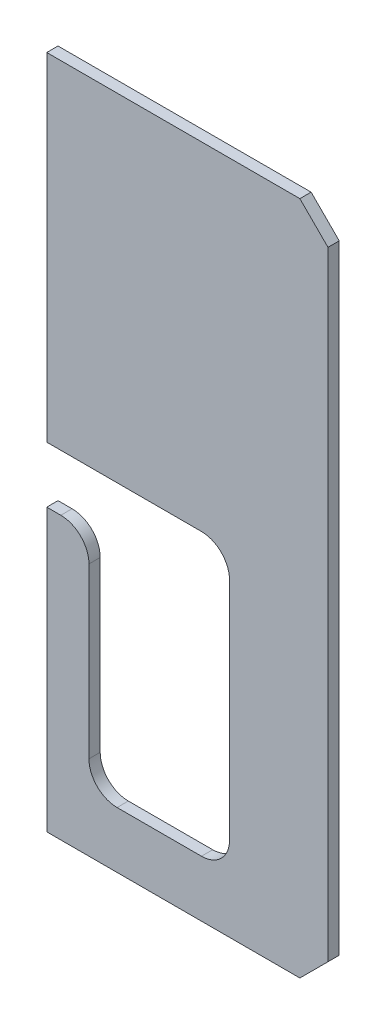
ISO-10303-21;
HEADER;
FILE_DESCRIPTION(('STEP AP214'),'2;1');
FILE_NAME('part.step','',(''),(''),'','','');
FILE_SCHEMA(('AUTOMOTIVE_DESIGN { 1 0 10303 214 1 1 1 1 }'));
ENDSEC;
DATA;
#1=APPLICATION_CONTEXT('core data for automotive mechanical design processes');
#2=APPLICATION_PROTOCOL_DEFINITION('international standard','automotive_design',2000,#1);
#3=PRODUCT_CONTEXT('',#1,'mechanical');
#4=PRODUCT('Part','Part','',(#3));
#5=PRODUCT_RELATED_PRODUCT_CATEGORY('part','',(#4));
#6=PRODUCT_DEFINITION_FORMATION('','',#4);
#7=PRODUCT_DEFINITION_CONTEXT('part definition',#1,'design');
#8=PRODUCT_DEFINITION('design','',#6,#7);
#9=PRODUCT_DEFINITION_SHAPE('','',#8);
#10=(LENGTH_UNIT() NAMED_UNIT(*) SI_UNIT(.MILLI.,.METRE.));
#11=(NAMED_UNIT(*) PLANE_ANGLE_UNIT() SI_UNIT($,.RADIAN.));
#12=(NAMED_UNIT(*) SI_UNIT($,.STERADIAN.) SOLID_ANGLE_UNIT());
#13=UNCERTAINTY_MEASURE_WITH_UNIT(LENGTH_MEASURE(1.E-05),#10,'distance_accuracy_value','');
#14=(GEOMETRIC_REPRESENTATION_CONTEXT(3) GLOBAL_UNCERTAINTY_ASSIGNED_CONTEXT((#13)) GLOBAL_UNIT_ASSIGNED_CONTEXT((#10,
#11,#12)) REPRESENTATION_CONTEXT('',''));
#15=CARTESIAN_POINT('',(0.,0.,0.));
#16=DIRECTION('',(0.,0.,1.));
#17=DIRECTION('',(1.,0.,0.));
#18=AXIS2_PLACEMENT_3D('',#15,#16,#17);
#19=CARTESIAN_POINT('',(0.,0.,4.));
#20=DIRECTION('',(1.,0.,0.));
#21=DIRECTION('',(0.,0.,-1.));
#22=AXIS2_PLACEMENT_3D('',#19,#20,#21);
#23=PLANE('',#22);
#24=DIRECTION('',(0.,-1.,0.));
#25=VECTOR('',#24,1.);
#26=CARTESIAN_POINT('',(0.,0.,0.));
#27=LINE('',#26,#25);
#28=CARTESIAN_POINT('',(0.,100.,0.));
#29=VERTEX_POINT('',#28);
#30=CARTESIAN_POINT('',(0.,0.,0.));
#31=VERTEX_POINT('',#30);
#32=EDGE_CURVE('E153',#29,#31,#27,.T.);
#33=ORIENTED_EDGE('',*,*,#32,.T.);
#34=DIRECTION('',(0.,0.,-1.));
#35=VECTOR('',#34,1.);
#36=CARTESIAN_POINT('',(0.,0.,4.));
#37=LINE('',#36,#35);
#38=CARTESIAN_POINT('',(0.,0.,4.));
#39=VERTEX_POINT('',#38);
#40=EDGE_CURVE('E11',#39,#31,#37,.T.);
#41=ORIENTED_EDGE('',*,*,#40,.F.);
#42=DIRECTION('',(0.,-1.,0.));
#43=VECTOR('',#42,1.);
#44=CARTESIAN_POINT('',(0.,0.,4.));
#45=LINE('',#44,#43);
#46=CARTESIAN_POINT('',(0.,100.,4.));
#47=VERTEX_POINT('',#46);
#48=EDGE_CURVE('E214',#47,#39,#45,.T.);
#49=ORIENTED_EDGE('',*,*,#48,.F.);
#50=DIRECTION('',(0.,0.,-1.));
#51=VECTOR('',#50,1.);
#52=CARTESIAN_POINT('',(0.,100.,4.));
#53=LINE('',#52,#51);
#54=EDGE_CURVE('E167',#47,#29,#53,.T.);
#55=ORIENTED_EDGE('',*,*,#54,.T.);
#56=EDGE_LOOP('',(#33,#41,#49,#55));
#57=FACE_BOUND('',#56,.T.);
#58=ADVANCED_FACE('F36',(#57),#23,.F.);
#59=CARTESIAN_POINT('',(0.,0.,4.));
#60=DIRECTION('',(0.,1.,0.));
#61=DIRECTION('',(0.,0.,1.));
#62=AXIS2_PLACEMENT_3D('',#59,#60,#61);
#63=PLANE('',#62);
#64=DIRECTION('',(1.,0.,0.));
#65=VECTOR('',#64,1.);
#66=CARTESIAN_POINT('',(0.,0.,0.));
#67=LINE('',#66,#65);
#68=CARTESIAN_POINT('',(90.,0.,0.));
#69=VERTEX_POINT('',#68);
#70=EDGE_CURVE('E149',#31,#69,#67,.T.);
#71=ORIENTED_EDGE('',*,*,#70,.T.);
#72=DIRECTION('',(0.,0.,-1.));
#73=VECTOR('',#72,1.);
#74=CARTESIAN_POINT('',(90.,0.,4.));
#75=LINE('',#74,#73);
#76=CARTESIAN_POINT('',(90.,0.,4.));
#77=VERTEX_POINT('',#76);
#78=EDGE_CURVE('E44',#77,#69,#75,.T.);
#79=ORIENTED_EDGE('',*,*,#78,.F.);
#80=DIRECTION('',(1.,0.,0.));
#81=VECTOR('',#80,1.);
#82=CARTESIAN_POINT('',(0.,0.,4.));
#83=LINE('',#82,#81);
#84=EDGE_CURVE('E163',#39,#77,#83,.T.);
#85=ORIENTED_EDGE('',*,*,#84,.F.);
#86=ORIENTED_EDGE('',*,*,#40,.T.);
#87=EDGE_LOOP('',(#71,#79,#85,#86));
#88=FACE_BOUND('',#87,.T.);
#89=ADVANCED_FACE('F162',(#88),#63,.F.);
#90=CARTESIAN_POINT('',(90.,0.,4.));
#91=DIRECTION('',(-0.707106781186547,0.707106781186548,0.));
#92=DIRECTION('',(-0.707106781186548,-0.707106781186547,0.));
#93=AXIS2_PLACEMENT_3D('',#90,#91,#92);
#94=PLANE('',#93);
#95=DIRECTION('',(0.707106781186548,0.707106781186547,0.));
#96=VECTOR('',#95,1.);
#97=CARTESIAN_POINT('',(90.,0.,0.));
#98=LINE('',#97,#96);
#99=CARTESIAN_POINT('',(100.,10.,0.));
#100=VERTEX_POINT('',#99);
#101=EDGE_CURVE('E155',#69,#100,#98,.T.);
#102=ORIENTED_EDGE('',*,*,#101,.T.);
#103=DIRECTION('',(0.,0.,-1.));
#104=VECTOR('',#103,1.);
#105=CARTESIAN_POINT('',(100.,10.,4.));
#106=LINE('',#105,#104);
#107=CARTESIAN_POINT('',(100.,10.,4.));
#108=VERTEX_POINT('',#107);
#109=EDGE_CURVE('E308',#108,#100,#106,.T.);
#110=ORIENTED_EDGE('',*,*,#109,.F.);
#111=DIRECTION('',(0.707106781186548,0.707106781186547,0.));
#112=VECTOR('',#111,1.);
#113=CARTESIAN_POINT('',(90.,0.,4.));
#114=LINE('',#113,#112);
#115=EDGE_CURVE('E219',#77,#108,#114,.T.);
#116=ORIENTED_EDGE('',*,*,#115,.F.);
#117=ORIENTED_EDGE('',*,*,#78,.T.);
#118=EDGE_LOOP('',(#102,#110,#116,#117));
#119=FACE_BOUND('',#118,.T.);
#120=ADVANCED_FACE('F313',(#119),#94,.F.);
#121=CARTESIAN_POINT('',(100.,10.,4.));
#122=DIRECTION('',(-1.,0.,0.));
#123=DIRECTION('',(0.,0.,1.));
#124=AXIS2_PLACEMENT_3D('',#121,#122,#123);
#125=PLANE('',#124);
#126=DIRECTION('',(0.,1.,0.));
#127=VECTOR('',#126,1.);
#128=CARTESIAN_POINT('',(100.,10.,0.));
#129=LINE('',#128,#127);
#130=CARTESIAN_POINT('',(100.,230.,0.));
#131=VERTEX_POINT('',#130);
#132=EDGE_CURVE('E175',#100,#131,#129,.T.);
#133=ORIENTED_EDGE('',*,*,#132,.T.);
#134=DIRECTION('',(0.,0.,-1.));
#135=VECTOR('',#134,1.);
#136=CARTESIAN_POINT('',(100.,230.,4.));
#137=LINE('',#136,#135);
#138=CARTESIAN_POINT('',(100.,230.,4.));
#139=VERTEX_POINT('',#138);
#140=EDGE_CURVE('E304',#139,#131,#137,.T.);
#141=ORIENTED_EDGE('',*,*,#140,.F.);
#142=DIRECTION('',(0.,1.,0.));
#143=VECTOR('',#142,1.);
#144=CARTESIAN_POINT('',(100.,10.,4.));
#145=LINE('',#144,#143);
#146=EDGE_CURVE('E222',#108,#139,#145,.T.);
#147=ORIENTED_EDGE('',*,*,#146,.F.);
#148=ORIENTED_EDGE('',*,*,#109,.T.);
#149=EDGE_LOOP('',(#133,#141,#147,#148));
#150=FACE_BOUND('',#149,.T.);
#151=ADVANCED_FACE('F321',(#150),#125,.F.);
#152=CARTESIAN_POINT('',(90.,240.,4.));
#153=DIRECTION('',(-0.707106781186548,-0.707106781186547,0.));
#154=DIRECTION('',(0.707106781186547,-0.707106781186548,0.));
#155=AXIS2_PLACEMENT_3D('',#152,#153,#154);
#156=PLANE('',#155);
#157=DIRECTION('',(-0.707106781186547,0.707106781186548,0.));
#158=VECTOR('',#157,1.);
#159=CARTESIAN_POINT('',(90.,240.,0.));
#160=LINE('',#159,#158);
#161=CARTESIAN_POINT('',(90.,240.,0.));
#162=VERTEX_POINT('',#161);
#163=EDGE_CURVE('E178',#131,#162,#160,.T.);
#164=ORIENTED_EDGE('',*,*,#163,.T.);
#165=DIRECTION('',(0.,0.,-1.));
#166=VECTOR('',#165,1.);
#167=CARTESIAN_POINT('',(90.,240.,4.));
#168=LINE('',#167,#166);
#169=CARTESIAN_POINT('',(90.,240.,4.));
#170=VERTEX_POINT('',#169);
#171=EDGE_CURVE('E300',#170,#162,#168,.T.);
#172=ORIENTED_EDGE('',*,*,#171,.F.);
#173=DIRECTION('',(-0.707106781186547,0.707106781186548,0.));
#174=VECTOR('',#173,1.);
#175=CARTESIAN_POINT('',(90.,240.,4.));
#176=LINE('',#175,#174);
#177=EDGE_CURVE('E225',#139,#170,#176,.T.);
#178=ORIENTED_EDGE('',*,*,#177,.F.);
#179=ORIENTED_EDGE('',*,*,#140,.T.);
#180=EDGE_LOOP('',(#164,#172,#178,#179));
#181=FACE_BOUND('',#180,.T.);
#182=ADVANCED_FACE('F324',(#181),#156,.F.);
#183=CARTESIAN_POINT('',(0.,240.,4.));
#184=DIRECTION('',(0.,-1.,0.));
#185=DIRECTION('',(0.,0.,-1.));
#186=AXIS2_PLACEMENT_3D('',#183,#184,#185);
#187=PLANE('',#186);
#188=DIRECTION('',(-1.,0.,0.));
#189=VECTOR('',#188,1.);
#190=CARTESIAN_POINT('',(0.,240.,0.));
#191=LINE('',#190,#189);
#192=CARTESIAN_POINT('',(0.,240.,0.));
#193=VERTEX_POINT('',#192);
#194=EDGE_CURVE('E181',#162,#193,#191,.T.);
#195=ORIENTED_EDGE('',*,*,#194,.T.);
#196=DIRECTION('',(0.,0.,-1.));
#197=VECTOR('',#196,1.);
#198=CARTESIAN_POINT('',(0.,240.,4.));
#199=LINE('',#198,#197);
#200=CARTESIAN_POINT('',(0.,240.,4.));
#201=VERTEX_POINT('',#200);
#202=EDGE_CURVE('E296',#201,#193,#199,.T.);
#203=ORIENTED_EDGE('',*,*,#202,.F.);
#204=DIRECTION('',(-1.,0.,0.));
#205=VECTOR('',#204,1.);
#206=CARTESIAN_POINT('',(0.,240.,4.));
#207=LINE('',#206,#205);
#208=EDGE_CURVE('E228',#170,#201,#207,.T.);
#209=ORIENTED_EDGE('',*,*,#208,.F.);
#210=ORIENTED_EDGE('',*,*,#171,.T.);
#211=EDGE_LOOP('',(#195,#203,#209,#210));
#212=FACE_BOUND('',#211,.T.);
#213=ADVANCED_FACE('F329',(#212),#187,.F.);
#214=CARTESIAN_POINT('',(0.,120.,4.));
#215=DIRECTION('',(1.,0.,0.));
#216=DIRECTION('',(0.,0.,-1.));
#217=AXIS2_PLACEMENT_3D('',#214,#215,#216);
#218=PLANE('',#217);
#219=DIRECTION('',(0.,-1.,0.));
#220=VECTOR('',#219,1.);
#221=CARTESIAN_POINT('',(0.,120.,0.));
#222=LINE('',#221,#220);
#223=CARTESIAN_POINT('',(0.,120.,0.));
#224=VERTEX_POINT('',#223);
#225=EDGE_CURVE('E184',#193,#224,#222,.T.);
#226=ORIENTED_EDGE('',*,*,#225,.T.);
#227=DIRECTION('',(0.,0.,-1.));
#228=VECTOR('',#227,1.);
#229=CARTESIAN_POINT('',(0.,120.,4.));
#230=LINE('',#229,#228);
#231=CARTESIAN_POINT('',(0.,120.,4.));
#232=VERTEX_POINT('',#231);
#233=EDGE_CURVE('E292',#232,#224,#230,.T.);
#234=ORIENTED_EDGE('',*,*,#233,.F.);
#235=DIRECTION('',(0.,-1.,0.));
#236=VECTOR('',#235,1.);
#237=CARTESIAN_POINT('',(0.,120.,4.));
#238=LINE('',#237,#236);
#239=EDGE_CURVE('E231',#201,#232,#238,.T.);
#240=ORIENTED_EDGE('',*,*,#239,.F.);
#241=ORIENTED_EDGE('',*,*,#202,.T.);
#242=EDGE_LOOP('',(#226,#234,#240,#241));
#243=FACE_BOUND('',#242,.T.);
#244=ADVANCED_FACE('F335',(#243),#218,.F.);
#245=CARTESIAN_POINT('',(54.9999999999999,120.,4.));
#246=DIRECTION('',(0.,1.,0.));
#247=DIRECTION('',(-1.,0.,0.));
#248=AXIS2_PLACEMENT_3D('',#245,#246,#247);
#249=PLANE('',#248);
#250=DIRECTION('',(1.,0.,0.));
#251=VECTOR('',#250,1.);
#252=CARTESIAN_POINT('',(54.9999999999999,120.,0.));
#253=LINE('',#252,#251);
#254=CARTESIAN_POINT('',(54.9999999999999,120.,0.));
#255=VERTEX_POINT('',#254);
#256=EDGE_CURVE('E187',#224,#255,#253,.T.);
#257=ORIENTED_EDGE('',*,*,#256,.T.);
#258=DIRECTION('',(0.,0.,-1.));
#259=VECTOR('',#258,1.);
#260=CARTESIAN_POINT('',(54.9999999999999,120.,4.));
#261=LINE('',#260,#259);
#262=CARTESIAN_POINT('',(54.9999999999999,120.,4.));
#263=VERTEX_POINT('',#262);
#264=EDGE_CURVE('E288',#263,#255,#261,.T.);
#265=ORIENTED_EDGE('',*,*,#264,.F.);
#266=DIRECTION('',(1.,0.,0.));
#267=VECTOR('',#266,1.);
#268=CARTESIAN_POINT('',(54.9999999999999,120.,4.));
#269=LINE('',#268,#267);
#270=EDGE_CURVE('E234',#232,#263,#269,.T.);
#271=ORIENTED_EDGE('',*,*,#270,.F.);
#272=ORIENTED_EDGE('',*,*,#233,.T.);
#273=EDGE_LOOP('',(#257,#265,#271,#272));
#274=FACE_BOUND('',#273,.T.);
#275=ADVANCED_FACE('F339',(#274),#249,.F.);
#276=CARTESIAN_POINT('',(55.,110.,4.));
#277=DIRECTION('',(0.,0.,-1.));
#278=DIRECTION('',(-1.,0.,0.));
#279=AXIS2_PLACEMENT_3D('',#276,#277,#278);
#280=CYLINDRICAL_SURFACE('',#279,9.99999999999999);
#281=CARTESIAN_POINT('',(55.,110.,0.));
#282=DIRECTION('',(0.,0.,-1.));
#283=DIRECTION('',(1.,0.,0.));
#284=AXIS2_PLACEMENT_3D('',#281,#282,#283);
#285=CIRCLE('',#284,9.99999999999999);
#286=CARTESIAN_POINT('',(65.,110.,0.));
#287=VERTEX_POINT('',#286);
#288=EDGE_CURVE('E190',#255,#287,#285,.T.);
#289=ORIENTED_EDGE('',*,*,#288,.T.);
#290=DIRECTION('',(0.,0.,-1.));
#291=VECTOR('',#290,1.);
#292=CARTESIAN_POINT('',(65.,110.,4.));
#293=LINE('',#292,#291);
#294=CARTESIAN_POINT('',(65.,110.,4.));
#295=VERTEX_POINT('',#294);
#296=EDGE_CURVE('E284',#295,#287,#293,.T.);
#297=ORIENTED_EDGE('',*,*,#296,.F.);
#298=CARTESIAN_POINT('',(55.,110.,4.));
#299=DIRECTION('',(0.,0.,-1.));
#300=DIRECTION('',(1.,0.,0.));
#301=AXIS2_PLACEMENT_3D('',#298,#299,#300);
#302=CIRCLE('',#301,9.99999999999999);
#303=EDGE_CURVE('E237',#263,#295,#302,.T.);
#304=ORIENTED_EDGE('',*,*,#303,.F.);
#305=ORIENTED_EDGE('',*,*,#264,.T.);
#306=EDGE_LOOP('',(#289,#297,#304,#305));
#307=FACE_BOUND('',#306,.T.);
#308=ADVANCED_FACE('F344',(#307),#280,.F.);
#309=CARTESIAN_POINT('',(65.,110.,4.));
#310=DIRECTION('',(1.,0.,0.));
#311=DIRECTION('',(0.,1.,0.));
#312=AXIS2_PLACEMENT_3D('',#309,#310,#311);
#313=PLANE('',#312);
#314=DIRECTION('',(0.,-1.,0.));
#315=VECTOR('',#314,1.);
#316=CARTESIAN_POINT('',(65.,110.,0.));
#317=LINE('',#316,#315);
#318=CARTESIAN_POINT('',(65.,30.0000000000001,0.));
#319=VERTEX_POINT('',#318);
#320=EDGE_CURVE('E193',#287,#319,#317,.T.);
#321=ORIENTED_EDGE('',*,*,#320,.T.);
#322=DIRECTION('',(0.,0.,-1.));
#323=VECTOR('',#322,1.);
#324=CARTESIAN_POINT('',(65.,30.0000000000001,4.));
#325=LINE('',#324,#323);
#326=CARTESIAN_POINT('',(65.,30.0000000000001,4.));
#327=VERTEX_POINT('',#326);
#328=EDGE_CURVE('E280',#327,#319,#325,.T.);
#329=ORIENTED_EDGE('',*,*,#328,.F.);
#330=DIRECTION('',(0.,-1.,0.));
#331=VECTOR('',#330,1.);
#332=CARTESIAN_POINT('',(65.,110.,4.));
#333=LINE('',#332,#331);
#334=EDGE_CURVE('E240',#295,#327,#333,.T.);
#335=ORIENTED_EDGE('',*,*,#334,.F.);
#336=ORIENTED_EDGE('',*,*,#296,.T.);
#337=EDGE_LOOP('',(#321,#329,#335,#336));
#338=FACE_BOUND('',#337,.T.);
#339=ADVANCED_FACE('F350',(#338),#313,.F.);
#340=CARTESIAN_POINT('',(55.,30.,4.));
#341=DIRECTION('',(0.,0.,-1.));
#342=DIRECTION('',(-1.,0.,0.));
#343=AXIS2_PLACEMENT_3D('',#340,#341,#342);
#344=CYLINDRICAL_SURFACE('',#343,10.);
#345=CARTESIAN_POINT('',(55.,30.,0.));
#346=DIRECTION('',(0.,0.,-1.));
#347=DIRECTION('',(1.,0.,0.));
#348=AXIS2_PLACEMENT_3D('',#345,#346,#347);
#349=CIRCLE('',#348,10.);
#350=CARTESIAN_POINT('',(54.9999999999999,20.,0.));
#351=VERTEX_POINT('',#350);
#352=EDGE_CURVE('E196',#319,#351,#349,.T.);
#353=ORIENTED_EDGE('',*,*,#352,.T.);
#354=DIRECTION('',(0.,0.,-1.));
#355=VECTOR('',#354,1.);
#356=CARTESIAN_POINT('',(54.9999999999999,20.,4.));
#357=LINE('',#356,#355);
#358=CARTESIAN_POINT('',(54.9999999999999,20.,4.));
#359=VERTEX_POINT('',#358);
#360=EDGE_CURVE('E276',#359,#351,#357,.T.);
#361=ORIENTED_EDGE('',*,*,#360,.F.);
#362=CARTESIAN_POINT('',(55.,30.,4.));
#363=DIRECTION('',(0.,0.,-1.));
#364=DIRECTION('',(1.,0.,0.));
#365=AXIS2_PLACEMENT_3D('',#362,#363,#364);
#366=CIRCLE('',#365,10.);
#367=EDGE_CURVE('E243',#327,#359,#366,.T.);
#368=ORIENTED_EDGE('',*,*,#367,.F.);
#369=ORIENTED_EDGE('',*,*,#328,.T.);
#370=EDGE_LOOP('',(#353,#361,#368,#369));
#371=FACE_BOUND('',#370,.T.);
#372=ADVANCED_FACE('F354',(#371),#344,.F.);
#373=CARTESIAN_POINT('',(25.0000000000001,20.,4.));
#374=DIRECTION('',(0.,-1.,0.));
#375=DIRECTION('',(0.,0.,-1.));
#376=AXIS2_PLACEMENT_3D('',#373,#374,#375);
#377=PLANE('',#376);
#378=DIRECTION('',(-1.,0.,0.));
#379=VECTOR('',#378,1.);
#380=CARTESIAN_POINT('',(25.0000000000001,20.,0.));
#381=LINE('',#380,#379);
#382=CARTESIAN_POINT('',(25.0000000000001,20.,0.));
#383=VERTEX_POINT('',#382);
#384=EDGE_CURVE('E199',#351,#383,#381,.T.);
#385=ORIENTED_EDGE('',*,*,#384,.T.);
#386=DIRECTION('',(0.,0.,-1.));
#387=VECTOR('',#386,1.);
#388=CARTESIAN_POINT('',(25.0000000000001,20.,4.));
#389=LINE('',#388,#387);
#390=CARTESIAN_POINT('',(25.0000000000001,20.,4.));
#391=VERTEX_POINT('',#390);
#392=EDGE_CURVE('E272',#391,#383,#389,.T.);
#393=ORIENTED_EDGE('',*,*,#392,.F.);
#394=DIRECTION('',(-1.,0.,0.));
#395=VECTOR('',#394,1.);
#396=CARTESIAN_POINT('',(25.0000000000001,20.,4.));
#397=LINE('',#396,#395);
#398=EDGE_CURVE('E246',#359,#391,#397,.T.);
#399=ORIENTED_EDGE('',*,*,#398,.F.);
#400=ORIENTED_EDGE('',*,*,#360,.T.);
#401=EDGE_LOOP('',(#385,#393,#399,#400));
#402=FACE_BOUND('',#401,.T.);
#403=ADVANCED_FACE('F359',(#402),#377,.F.);
#404=CARTESIAN_POINT('',(25.,30.,4.));
#405=DIRECTION('',(0.,0.,-1.));
#406=DIRECTION('',(-1.,0.,0.));
#407=AXIS2_PLACEMENT_3D('',#404,#405,#406);
#408=CYLINDRICAL_SURFACE('',#407,10.);
#409=CARTESIAN_POINT('',(25.,30.,0.));
#410=DIRECTION('',(0.,0.,-1.));
#411=DIRECTION('',(-1.,0.,0.));
#412=AXIS2_PLACEMENT_3D('',#409,#410,#411);
#413=CIRCLE('',#412,10.);
#414=CARTESIAN_POINT('',(15.,30.0000000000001,0.));
#415=VERTEX_POINT('',#414);
#416=EDGE_CURVE('E202',#383,#415,#413,.T.);
#417=ORIENTED_EDGE('',*,*,#416,.T.);
#418=DIRECTION('',(0.,0.,-1.));
#419=VECTOR('',#418,1.);
#420=CARTESIAN_POINT('',(15.,30.0000000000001,4.));
#421=LINE('',#420,#419);
#422=CARTESIAN_POINT('',(15.,30.0000000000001,4.));
#423=VERTEX_POINT('',#422);
#424=EDGE_CURVE('E268',#423,#415,#421,.T.);
#425=ORIENTED_EDGE('',*,*,#424,.F.);
#426=CARTESIAN_POINT('',(25.,30.,4.));
#427=DIRECTION('',(0.,0.,-1.));
#428=DIRECTION('',(-1.,0.,0.));
#429=AXIS2_PLACEMENT_3D('',#426,#427,#428);
#430=CIRCLE('',#429,10.);
#431=EDGE_CURVE('E249',#391,#423,#430,.T.);
#432=ORIENTED_EDGE('',*,*,#431,.F.);
#433=ORIENTED_EDGE('',*,*,#392,.T.);
#434=EDGE_LOOP('',(#417,#425,#432,#433));
#435=FACE_BOUND('',#434,.T.);
#436=ADVANCED_FACE('F365',(#435),#408,.F.);
#437=CARTESIAN_POINT('',(15.,89.9999999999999,4.));
#438=DIRECTION('',(-1.,0.,0.));
#439=DIRECTION('',(0.,-1.,0.));
#440=AXIS2_PLACEMENT_3D('',#437,#438,#439);
#441=PLANE('',#440);
#442=DIRECTION('',(0.,1.,0.));
#443=VECTOR('',#442,1.);
#444=CARTESIAN_POINT('',(15.,89.9999999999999,0.));
#445=LINE('',#444,#443);
#446=CARTESIAN_POINT('',(15.,89.9999999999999,0.));
#447=VERTEX_POINT('',#446);
#448=EDGE_CURVE('E205',#415,#447,#445,.T.);
#449=ORIENTED_EDGE('',*,*,#448,.T.);
#450=DIRECTION('',(0.,0.,-1.));
#451=VECTOR('',#450,1.);
#452=CARTESIAN_POINT('',(15.,89.9999999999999,4.));
#453=LINE('',#452,#451);
#454=CARTESIAN_POINT('',(15.,89.9999999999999,4.));
#455=VERTEX_POINT('',#454);
#456=EDGE_CURVE('E264',#455,#447,#453,.T.);
#457=ORIENTED_EDGE('',*,*,#456,.F.);
#458=DIRECTION('',(0.,1.,0.));
#459=VECTOR('',#458,1.);
#460=CARTESIAN_POINT('',(15.,89.9999999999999,4.));
#461=LINE('',#460,#459);
#462=EDGE_CURVE('E252',#423,#455,#461,.T.);
#463=ORIENTED_EDGE('',*,*,#462,.F.);
#464=ORIENTED_EDGE('',*,*,#424,.T.);
#465=EDGE_LOOP('',(#449,#457,#463,#464));
#466=FACE_BOUND('',#465,.T.);
#467=ADVANCED_FACE('F369',(#466),#441,.F.);
#468=CARTESIAN_POINT('',(5.,90.,4.));
#469=DIRECTION('',(0.,0.,-1.));
#470=DIRECTION('',(-1.,0.,0.));
#471=AXIS2_PLACEMENT_3D('',#468,#469,#470);
#472=CYLINDRICAL_SURFACE('',#471,10.);
#473=CARTESIAN_POINT('',(5.,90.,0.));
#474=DIRECTION('',(0.,0.,1.));
#475=DIRECTION('',(1.,0.,0.));
#476=AXIS2_PLACEMENT_3D('',#473,#474,#475);
#477=CIRCLE('',#476,10.);
#478=CARTESIAN_POINT('',(4.99999999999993,100.,0.));
#479=VERTEX_POINT('',#478);
#480=EDGE_CURVE('E208',#447,#479,#477,.T.);
#481=ORIENTED_EDGE('',*,*,#480,.T.);
#482=DIRECTION('',(0.,0.,-1.));
#483=VECTOR('',#482,1.);
#484=CARTESIAN_POINT('',(4.99999999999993,100.,4.));
#485=LINE('',#484,#483);
#486=CARTESIAN_POINT('',(4.99999999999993,100.,4.));
#487=VERTEX_POINT('',#486);
#488=EDGE_CURVE('E260',#487,#479,#485,.T.);
#489=ORIENTED_EDGE('',*,*,#488,.F.);
#490=CARTESIAN_POINT('',(5.,90.,4.));
#491=DIRECTION('',(0.,0.,1.));
#492=DIRECTION('',(1.,0.,0.));
#493=AXIS2_PLACEMENT_3D('',#490,#491,#492);
#494=CIRCLE('',#493,10.);
#495=EDGE_CURVE('E56',#455,#487,#494,.T.);
#496=ORIENTED_EDGE('',*,*,#495,.F.);
#497=ORIENTED_EDGE('',*,*,#456,.T.);
#498=EDGE_LOOP('',(#481,#489,#496,#497));
#499=FACE_BOUND('',#498,.T.);
#500=ADVANCED_FACE('F372',(#499),#472,.T.);
#501=CARTESIAN_POINT('',(0.,100.,4.));
#502=DIRECTION('',(0.,-1.,0.));
#503=DIRECTION('',(0.,0.,-1.));
#504=AXIS2_PLACEMENT_3D('',#501,#502,#503);
#505=PLANE('',#504);
#506=DIRECTION('',(-1.,0.,0.));
#507=VECTOR('',#506,1.);
#508=CARTESIAN_POINT('',(0.,100.,0.));
#509=LINE('',#508,#507);
#510=EDGE_CURVE('E211',#479,#29,#509,.T.);
#511=ORIENTED_EDGE('',*,*,#510,.T.);
#512=ORIENTED_EDGE('',*,*,#54,.F.);
#513=DIRECTION('',(-1.,0.,0.));
#514=VECTOR('',#513,1.);
#515=CARTESIAN_POINT('',(0.,100.,4.));
#516=LINE('',#515,#514);
#517=EDGE_CURVE('E51',#487,#47,#516,.T.);
#518=ORIENTED_EDGE('',*,*,#517,.F.);
#519=ORIENTED_EDGE('',*,*,#488,.T.);
#520=EDGE_LOOP('',(#511,#512,#518,#519));
#521=FACE_BOUND('',#520,.T.);
#522=ADVANCED_FACE('F374',(#521),#505,.F.);
#523=CARTESIAN_POINT('',(5.,90.,4.));
#524=DIRECTION('',(0.,0.,1.));
#525=DIRECTION('',(1.,0.,0.));
#526=AXIS2_PLACEMENT_3D('',#523,#524,#525);
#527=PLANE('',#526);
#528=ORIENTED_EDGE('',*,*,#48,.T.);
#529=ORIENTED_EDGE('',*,*,#84,.T.);
#530=ORIENTED_EDGE('',*,*,#115,.T.);
#531=ORIENTED_EDGE('',*,*,#146,.T.);
#532=ORIENTED_EDGE('',*,*,#177,.T.);
#533=ORIENTED_EDGE('',*,*,#208,.T.);
#534=ORIENTED_EDGE('',*,*,#239,.T.);
#535=ORIENTED_EDGE('',*,*,#270,.T.);
#536=ORIENTED_EDGE('',*,*,#303,.T.);
#537=ORIENTED_EDGE('',*,*,#334,.T.);
#538=ORIENTED_EDGE('',*,*,#367,.T.);
#539=ORIENTED_EDGE('',*,*,#398,.T.);
#540=ORIENTED_EDGE('',*,*,#431,.T.);
#541=ORIENTED_EDGE('',*,*,#462,.T.);
#542=ORIENTED_EDGE('',*,*,#495,.T.);
#543=ORIENTED_EDGE('',*,*,#517,.T.);
#544=EDGE_LOOP('',(#528,#529,#530,#531,#532,#533,#534,#535,#536,#537,#538,#539,#540,#541,#542,#543));
#545=FACE_BOUND('',#544,.T.);
#546=ADVANCED_FACE('F316',(#545),#527,.T.);
#547=CARTESIAN_POINT('',(5.,90.,0.));
#548=DIRECTION('',(0.,0.,1.));
#549=DIRECTION('',(1.,0.,0.));
#550=AXIS2_PLACEMENT_3D('',#547,#548,#549);
#551=PLANE('',#550);
#552=ORIENTED_EDGE('',*,*,#32,.F.);
#553=ORIENTED_EDGE('',*,*,#510,.F.);
#554=ORIENTED_EDGE('',*,*,#480,.F.);
#555=ORIENTED_EDGE('',*,*,#448,.F.);
#556=ORIENTED_EDGE('',*,*,#416,.F.);
#557=ORIENTED_EDGE('',*,*,#384,.F.);
#558=ORIENTED_EDGE('',*,*,#352,.F.);
#559=ORIENTED_EDGE('',*,*,#320,.F.);
#560=ORIENTED_EDGE('',*,*,#288,.F.);
#561=ORIENTED_EDGE('',*,*,#256,.F.);
#562=ORIENTED_EDGE('',*,*,#225,.F.);
#563=ORIENTED_EDGE('',*,*,#194,.F.);
#564=ORIENTED_EDGE('',*,*,#163,.F.);
#565=ORIENTED_EDGE('',*,*,#132,.F.);
#566=ORIENTED_EDGE('',*,*,#101,.F.);
#567=ORIENTED_EDGE('',*,*,#70,.F.);
#568=EDGE_LOOP('',(#552,#553,#554,#555,#556,#557,#558,#559,#560,#561,#562,#563,#564,#565,#566,#567));
#569=FACE_BOUND('',#568,.T.);
#570=ADVANCED_FACE('F150',(#569),#551,.F.);
#571=CLOSED_SHELL('',(#58,#89,#120,#151,#182,#213,#244,#275,#308,#339,#372,#403,#436,#467,#500,
#522,#546,#570));
#572=MANIFOLD_SOLID_BREP('B2',#571);
#573=ADVANCED_BREP_SHAPE_REPRESENTATION('',(#18,#572),#14);
#574=SHAPE_DEFINITION_REPRESENTATION(#9,#573);
ENDSEC;
END-ISO-10303-21;
